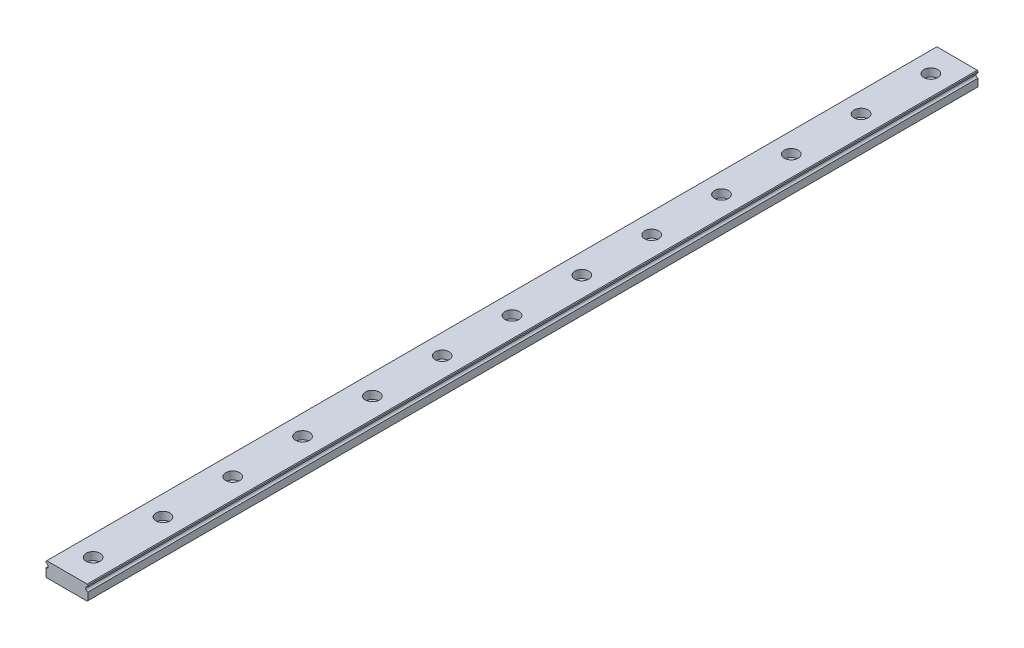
from build123d import *

# Parameters (mm, degrees)
EXTRUDE_1_DEPTH           = 510
HOLE_WIZARD_1_D           = 4.5
HOLE_WIZARD_1_CBORE_D     = 8
HOLE_WIZARD_1_CBORE_DEPTH = 4.5
PATTERN_LINEAR_1_COUNT    = 13
PATTERN_LINEAR_1_PITCH    = 40


with BuildPart() as part:
    # Sketch 1 → Extrude 1 (new body)
    with BuildSketch(Plane.XY):
        with BuildLine():
            Line((-12, 3), (-12, 3.85))
            Line((-12, 3.85), (-11.6, 4.25))
            Line((-11.6, 4.25), (11.6, 4.25))
            Line((11.6, 4.25), (12, 3.85))
            Line((12, 3.85), (12, 3))
            ThreePointArc((12, 3), (10.75, 1.75), (12, 0.5))
            Line((12, 0.5), (12, -3.85))
            Line((12, -3.85), (11.6, -4.25))
            Line((11.6, -4.25), (6.3, -4.25))
            ThreePointArc((6.3, -4.25), (6, -3.95), (5.7, -4.25))
            Line((5.7, -4.25), (-11.6, -4.25))
            Line((-11.6, -4.25), (-12, -3.85))
            Line((-12, -3.85), (-12, 0.5))
            ThreePointArc((-12, 0.5), (-10.75, 1.75), (-12, 3))
        make_face()
    extrude(amount=-EXTRUDE_1_DEPTH)

    # Hole Wizard 1 (through all)
    with Locations(Plane(origin=(0, 4.25, 0), x_dir=(1, 0, 0), z_dir=(0, 1, 0))):
        with Locations((0, 15)):
            hole_wizard_1 = CounterBoreHole(HOLE_WIZARD_1_D / 2, HOLE_WIZARD_1_CBORE_D / 2, HOLE_WIZARD_1_CBORE_DEPTH)

    # Pattern Linear 1: Hole Wizard 1 ×13
    with Locations(*[(0, 0, -i * PATTERN_LINEAR_1_PITCH) for i in range(1, PATTERN_LINEAR_1_COUNT)]):
        add(hole_wizard_1, mode=Mode.SUBTRACT)


solid = part.part
